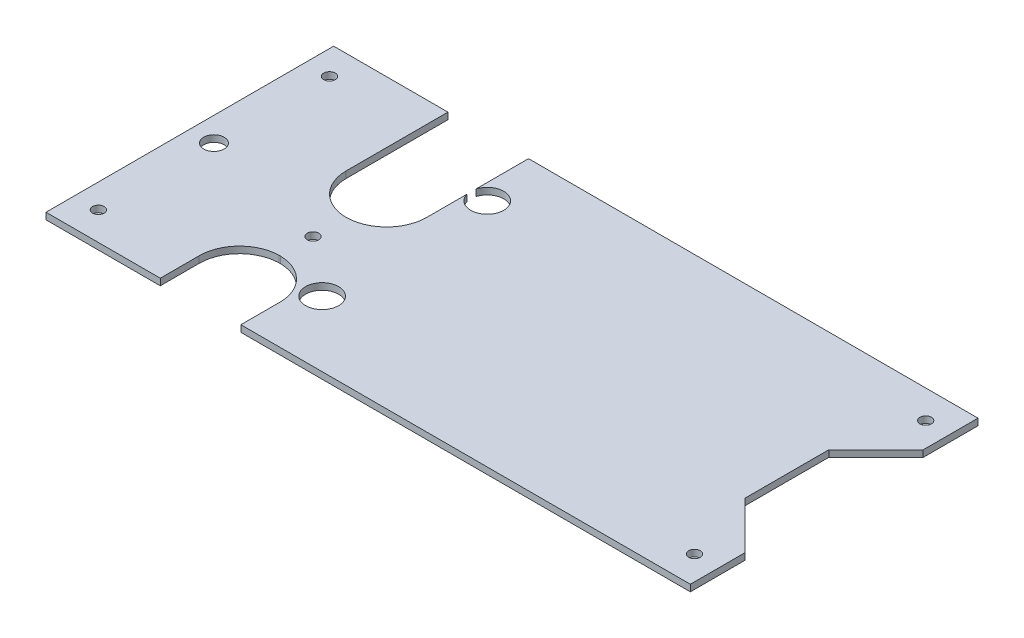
ISO-10303-21;
HEADER;
FILE_DESCRIPTION(('STEP AP214'),'2;1');
FILE_NAME('part.step','',(''),(''),'','','');
FILE_SCHEMA(('AUTOMOTIVE_DESIGN { 1 0 10303 214 1 1 1 1 }'));
ENDSEC;
DATA;
#1=APPLICATION_CONTEXT('core data for automotive mechanical design processes');
#2=APPLICATION_PROTOCOL_DEFINITION('international standard','automotive_design',2000,#1);
#3=PRODUCT_CONTEXT('',#1,'mechanical');
#4=PRODUCT('Part','Part','',(#3));
#5=PRODUCT_RELATED_PRODUCT_CATEGORY('part','',(#4));
#6=PRODUCT_DEFINITION_FORMATION('','',#4);
#7=PRODUCT_DEFINITION_CONTEXT('part definition',#1,'design');
#8=PRODUCT_DEFINITION('design','',#6,#7);
#9=PRODUCT_DEFINITION_SHAPE('','',#8);
#10=(LENGTH_UNIT() NAMED_UNIT(*) SI_UNIT(.MILLI.,.METRE.));
#11=(NAMED_UNIT(*) PLANE_ANGLE_UNIT() SI_UNIT($,.RADIAN.));
#12=(NAMED_UNIT(*) SI_UNIT($,.STERADIAN.) SOLID_ANGLE_UNIT());
#13=UNCERTAINTY_MEASURE_WITH_UNIT(LENGTH_MEASURE(1.E-05),#10,'distance_accuracy_value','');
#14=(GEOMETRIC_REPRESENTATION_CONTEXT(3) GLOBAL_UNCERTAINTY_ASSIGNED_CONTEXT((#13)) GLOBAL_UNIT_ASSIGNED_CONTEXT((#10,
#11,#12)) REPRESENTATION_CONTEXT('',''));
#15=CARTESIAN_POINT('',(0.,0.,0.));
#16=DIRECTION('',(0.,0.,1.));
#17=DIRECTION('',(1.,0.,0.));
#18=AXIS2_PLACEMENT_3D('',#15,#16,#17);
#19=CARTESIAN_POINT('',(-42.4176061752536,2.,33.7029048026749));
#20=DIRECTION('',(0.,1.,0.));
#21=DIRECTION('',(0.,0.,1.));
#22=AXIS2_PLACEMENT_3D('',#19,#20,#21);
#23=PLANE('',#22);
#24=CARTESIAN_POINT('',(98.5823938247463,2.,-33.0470951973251));
#25=DIRECTION('',(0.,1.,0.));
#26=DIRECTION('',(0.,0.,1.));
#27=AXIS2_PLACEMENT_3D('',#24,#25,#26);
#28=CIRCLE('',#27,1.75);
#29=CARTESIAN_POINT('',(98.5823938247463,2.,-31.2970951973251));
#30=VERTEX_POINT('',#29);
#31=EDGE_CURVE('E435',#30,#30,#28,.T.);
#32=ORIENTED_EDGE('',*,*,#31,.F.);
#33=EDGE_LOOP('',(#32));
#34=FACE_BOUND('',#33,.T.);
#35=CARTESIAN_POINT('',(-42.4176061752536,2.,11.4529048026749));
#36=DIRECTION('',(0.,1.,0.));
#37=DIRECTION('',(0.,0.,1.));
#38=AXIS2_PLACEMENT_3D('',#35,#36,#37);
#39=CIRCLE('',#38,1.75);
#40=CARTESIAN_POINT('',(-42.4176061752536,2.,13.2029048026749));
#41=VERTEX_POINT('',#40);
#42=EDGE_CURVE('E447',#41,#41,#39,.T.);
#43=ORIENTED_EDGE('',*,*,#42,.F.);
#44=EDGE_LOOP('',(#43));
#45=FACE_BOUND('',#44,.T.);
#46=CARTESIAN_POINT('',(-81.9176061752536,2.,36.9529048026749));
#47=DIRECTION('',(0.,1.,0.));
#48=DIRECTION('',(0.,0.,1.));
#49=AXIS2_PLACEMENT_3D('',#46,#47,#48);
#50=CIRCLE('',#49,1.75);
#51=CARTESIAN_POINT('',(-81.9176061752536,2.,38.7029048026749));
#52=VERTEX_POINT('',#51);
#53=EDGE_CURVE('E459',#52,#52,#50,.T.);
#54=ORIENTED_EDGE('',*,*,#53,.F.);
#55=EDGE_LOOP('',(#54));
#56=FACE_BOUND('',#55,.T.);
#57=CARTESIAN_POINT('',(-42.4176061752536,2.,33.7029048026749));
#58=DIRECTION('',(0.,-1.,0.));
#59=DIRECTION('',(0.,0.,1.));
#60=AXIS2_PLACEMENT_3D('',#57,#58,#59);
#61=CIRCLE('',#60,12.2);
#62=CARTESIAN_POINT('',(-54.6176061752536,2.,33.7029048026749));
#63=VERTEX_POINT('',#62);
#64=CARTESIAN_POINT('',(-42.6689869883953,2.,21.5054949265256));
#65=VERTEX_POINT('',#64);
#66=EDGE_CURVE('E259',#63,#65,#61,.T.);
#67=ORIENTED_EDGE('',*,*,#66,.T.);
#68=DIRECTION('',(1.,0.,0.));
#69=VECTOR('',#68,1.);
#70=CARTESIAN_POINT('',(-42.6689869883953,2.,21.5054949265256));
#71=LINE('',#70,#69);
#72=CARTESIAN_POINT('',(-42.1662253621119,2.,21.5054949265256));
#73=VERTEX_POINT('',#72);
#74=EDGE_CURVE('E137',#65,#73,#71,.T.);
#75=ORIENTED_EDGE('',*,*,#74,.T.);
#76=CARTESIAN_POINT('',(-42.4176061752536,2.,33.7029048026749));
#77=DIRECTION('',(0.,-1.,0.));
#78=DIRECTION('',(0.,0.,1.));
#79=AXIS2_PLACEMENT_3D('',#76,#77,#78);
#80=CIRCLE('',#79,12.2);
#81=CARTESIAN_POINT('',(-30.2176061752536,2.,33.7029048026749));
#82=VERTEX_POINT('',#81);
#83=EDGE_CURVE('E316',#73,#82,#80,.T.);
#84=ORIENTED_EDGE('',*,*,#83,.T.);
#85=DIRECTION('',(0.,0.,1.));
#86=VECTOR('',#85,1.);
#87=CARTESIAN_POINT('',(-30.2176061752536,2.,45.5029048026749));
#88=LINE('',#87,#86);
#89=CARTESIAN_POINT('',(-30.2176061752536,2.,45.5029048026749));
#90=VERTEX_POINT('',#89);
#91=EDGE_CURVE('E335',#82,#90,#88,.T.);
#92=ORIENTED_EDGE('',*,*,#91,.T.);
#93=DIRECTION('',(1.,0.,0.));
#94=VECTOR('',#93,1.);
#95=CARTESIAN_POINT('',(-30.2176061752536,2.,45.5029048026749));
#96=LINE('',#95,#94);
#97=CARTESIAN_POINT('',(105.882393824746,2.,45.5029048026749));
#98=VERTEX_POINT('',#97);
#99=EDGE_CURVE('E332',#90,#98,#96,.T.);
#100=ORIENTED_EDGE('',*,*,#99,.T.);
#101=DIRECTION('',(0.,0.,-1.));
#102=VECTOR('',#101,1.);
#103=CARTESIAN_POINT('',(105.882393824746,2.,45.5029048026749));
#104=LINE('',#103,#102);
#105=CARTESIAN_POINT('',(105.882393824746,2.,28.9171183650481));
#106=VERTEX_POINT('',#105);
#107=EDGE_CURVE('E334',#98,#106,#104,.T.);
#108=ORIENTED_EDGE('',*,*,#107,.T.);
#109=DIRECTION('',(-0.707106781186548,0.,-0.707106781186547));
#110=VECTOR('',#109,1.);
#111=CARTESIAN_POINT('',(91.5823938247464,2.,14.6171183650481));
#112=LINE('',#111,#110);
#113=CARTESIAN_POINT('',(91.5823938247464,2.,14.6171183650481));
#114=VERTEX_POINT('',#113);
#115=EDGE_CURVE('E337',#106,#114,#112,.T.);
#116=ORIENTED_EDGE('',*,*,#115,.T.);
#117=DIRECTION('',(0.,0.,-1.));
#118=VECTOR('',#117,1.);
#119=CARTESIAN_POINT('',(91.5823938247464,2.,-10.7113087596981));
#120=LINE('',#119,#118);
#121=CARTESIAN_POINT('',(91.5823938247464,2.,-10.7113087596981));
#122=VERTEX_POINT('',#121);
#123=EDGE_CURVE('E343',#114,#122,#120,.T.);
#124=ORIENTED_EDGE('',*,*,#123,.T.);
#125=DIRECTION('',(0.707106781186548,0.,-0.707106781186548));
#126=VECTOR('',#125,1.);
#127=CARTESIAN_POINT('',(105.882393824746,2.,-25.0113087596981));
#128=LINE('',#127,#126);
#129=CARTESIAN_POINT('',(105.882393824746,2.,-25.0113087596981));
#130=VERTEX_POINT('',#129);
#131=EDGE_CURVE('E345',#122,#130,#128,.T.);
#132=ORIENTED_EDGE('',*,*,#131,.T.);
#133=DIRECTION('',(0.,0.,-1.));
#134=VECTOR('',#133,1.);
#135=CARTESIAN_POINT('',(105.882393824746,2.,-25.0113087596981));
#136=LINE('',#135,#134);
#137=CARTESIAN_POINT('',(105.882393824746,2.,-41.5970951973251));
#138=VERTEX_POINT('',#137);
#139=EDGE_CURVE('E347',#130,#138,#136,.T.);
#140=ORIENTED_EDGE('',*,*,#139,.T.);
#141=DIRECTION('',(-1.,0.,0.));
#142=VECTOR('',#141,1.);
#143=CARTESIAN_POINT('',(-30.2176061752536,2.,-41.5970951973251));
#144=LINE('',#143,#142);
#145=CARTESIAN_POINT('',(-30.2176061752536,2.,-41.5970951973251));
#146=VERTEX_POINT('',#145);
#147=EDGE_CURVE('E349',#138,#146,#144,.T.);
#148=ORIENTED_EDGE('',*,*,#147,.T.);
#149=DIRECTION('',(0.,0.,1.));
#150=VECTOR('',#149,1.);
#151=CARTESIAN_POINT('',(-30.2176061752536,2.,-25.6971802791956));
#152=LINE('',#151,#150);
#153=CARTESIAN_POINT('',(-30.2176061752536,2.,-25.6971802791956));
#154=VERTEX_POINT('',#153);
#155=EDGE_CURVE('E351',#146,#154,#152,.T.);
#156=ORIENTED_EDGE('',*,*,#155,.T.);
#157=CARTESIAN_POINT('',(-25.4176286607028,2.,-24.2971031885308));
#158=DIRECTION('',(0.,-1.,0.));
#159=DIRECTION('',(0.,0.,1.));
#160=AXIS2_PLACEMENT_3D('',#157,#158,#159);
#161=CIRCLE('',#160,4.99999999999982);
#162=CARTESIAN_POINT('',(-30.2176061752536,2.,-22.8970260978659));
#163=VERTEX_POINT('',#162);
#164=EDGE_CURVE('E353',#154,#163,#161,.T.);
#165=ORIENTED_EDGE('',*,*,#164,.T.);
#166=DIRECTION('',(0.,0.,1.));
#167=VECTOR('',#166,1.);
#168=CARTESIAN_POINT('',(-30.2176061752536,2.,-10.7970951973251));
#169=LINE('',#168,#167);
#170=CARTESIAN_POINT('',(-30.2176061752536,2.,-10.7970951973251));
#171=VERTEX_POINT('',#170);
#172=EDGE_CURVE('E355',#163,#171,#169,.T.);
#173=ORIENTED_EDGE('',*,*,#172,.T.);
#174=CARTESIAN_POINT('',(-42.4176061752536,2.,-10.7970951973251));
#175=DIRECTION('',(0.,-1.,0.));
#176=DIRECTION('',(0.,0.,1.));
#177=AXIS2_PLACEMENT_3D('',#174,#175,#176);
#178=CIRCLE('',#177,12.2);
#179=CARTESIAN_POINT('',(-42.163439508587,2.,1.40025694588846));
#180=VERTEX_POINT('',#179);
#181=EDGE_CURVE('E357',#171,#180,#178,.T.);
#182=ORIENTED_EDGE('',*,*,#181,.T.);
#183=DIRECTION('',(-1.,0.,0.));
#184=VECTOR('',#183,1.);
#185=CARTESIAN_POINT('',(-42.6717728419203,2.,1.40025694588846));
#186=LINE('',#185,#184);
#187=CARTESIAN_POINT('',(-42.6717728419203,2.,1.40025694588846));
#188=VERTEX_POINT('',#187);
#189=EDGE_CURVE('E359',#180,#188,#186,.T.);
#190=ORIENTED_EDGE('',*,*,#189,.T.);
#191=CARTESIAN_POINT('',(-42.4176061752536,2.,-10.7970951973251));
#192=DIRECTION('',(0.,-1.,0.));
#193=DIRECTION('',(0.,0.,1.));
#194=AXIS2_PLACEMENT_3D('',#191,#192,#193);
#195=CIRCLE('',#194,12.2);
#196=CARTESIAN_POINT('',(-54.6176061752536,2.,-10.7970951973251));
#197=VERTEX_POINT('',#196);
#198=EDGE_CURVE('E361',#188,#197,#195,.T.);
#199=ORIENTED_EDGE('',*,*,#198,.T.);
#200=DIRECTION('',(0.,0.,-1.));
#201=VECTOR('',#200,1.);
#202=CARTESIAN_POINT('',(-54.6176061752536,2.,-41.5970951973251));
#203=LINE('',#202,#201);
#204=CARTESIAN_POINT('',(-54.6176061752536,2.,-41.5970951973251));
#205=VERTEX_POINT('',#204);
#206=EDGE_CURVE('E363',#197,#205,#203,.T.);
#207=ORIENTED_EDGE('',*,*,#206,.T.);
#208=DIRECTION('',(-1.,0.,0.));
#209=VECTOR('',#208,1.);
#210=CARTESIAN_POINT('',(-89.2176061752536,2.,-41.5970951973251));
#211=LINE('',#210,#209);
#212=CARTESIAN_POINT('',(-89.2176061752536,2.,-41.5970951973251));
#213=VERTEX_POINT('',#212);
#214=EDGE_CURVE('E198',#205,#213,#211,.T.);
#215=ORIENTED_EDGE('',*,*,#214,.T.);
#216=DIRECTION('',(0.,0.,1.));
#217=VECTOR('',#216,1.);
#218=CARTESIAN_POINT('',(-89.2176061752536,2.,-41.5970951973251));
#219=LINE('',#218,#217);
#220=CARTESIAN_POINT('',(-89.2176061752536,2.,45.5029048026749));
#221=VERTEX_POINT('',#220);
#222=EDGE_CURVE('E192',#213,#221,#219,.T.);
#223=ORIENTED_EDGE('',*,*,#222,.T.);
#224=DIRECTION('',(1.,0.,0.));
#225=VECTOR('',#224,1.);
#226=CARTESIAN_POINT('',(-89.2176061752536,2.,45.5029048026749));
#227=LINE('',#226,#225);
#228=CARTESIAN_POINT('',(-54.6176061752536,2.,45.5029048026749));
#229=VERTEX_POINT('',#228);
#230=EDGE_CURVE('E196',#221,#229,#227,.T.);
#231=ORIENTED_EDGE('',*,*,#230,.T.);
#232=DIRECTION('',(0.,0.,-1.));
#233=VECTOR('',#232,1.);
#234=CARTESIAN_POINT('',(-54.6176061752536,2.,33.7029048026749));
#235=LINE('',#234,#233);
#236=EDGE_CURVE('E52',#229,#63,#235,.T.);
#237=ORIENTED_EDGE('',*,*,#236,.T.);
#238=EDGE_LOOP('',(#67,#75,#84,#92,#100,#108,#116,#124,#132,#140,#148,#156,#165,#173,#182,#190,
#199,#207,#215,#223,#231,#237));
#239=FACE_BOUND('',#238,.T.);
#240=CARTESIAN_POINT('',(-81.9176061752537,2.,-33.0470951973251));
#241=DIRECTION('',(0.,1.,0.));
#242=DIRECTION('',(0.,0.,1.));
#243=AXIS2_PLACEMENT_3D('',#240,#241,#242);
#244=CIRCLE('',#243,1.75);
#245=CARTESIAN_POINT('',(-81.9176061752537,2.,-31.2970951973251));
#246=VERTEX_POINT('',#245);
#247=EDGE_CURVE('E220',#246,#246,#244,.T.);
#248=ORIENTED_EDGE('',*,*,#247,.F.);
#249=EDGE_LOOP('',(#248));
#250=FACE_BOUND('',#249,.T.);
#251=CARTESIAN_POINT('',(-81.9176061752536,2.,1.95290480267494));
#252=DIRECTION('',(0.,1.,0.));
#253=DIRECTION('',(0.,0.,1.));
#254=AXIS2_PLACEMENT_3D('',#251,#252,#253);
#255=CIRCLE('',#254,3.1);
#256=CARTESIAN_POINT('',(-81.9176061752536,2.,5.05290480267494));
#257=VERTEX_POINT('',#256);
#258=EDGE_CURVE('E453',#257,#257,#255,.T.);
#259=ORIENTED_EDGE('',*,*,#258,.F.);
#260=EDGE_LOOP('',(#259));
#261=FACE_BOUND('',#260,.T.);
#262=CARTESIAN_POINT('',(98.5823938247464,2.,36.9529048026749));
#263=DIRECTION('',(0.,1.,0.));
#264=DIRECTION('',(0.,0.,1.));
#265=AXIS2_PLACEMENT_3D('',#262,#263,#264);
#266=CIRCLE('',#265,1.75);
#267=CARTESIAN_POINT('',(98.5823938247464,2.,38.7029048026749));
#268=VERTEX_POINT('',#267);
#269=EDGE_CURVE('E441',#268,#268,#266,.T.);
#270=ORIENTED_EDGE('',*,*,#269,.F.);
#271=EDGE_LOOP('',(#270));
#272=FACE_BOUND('',#271,.T.);
#273=CARTESIAN_POINT('',(-25.4176286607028,2.,25.7028968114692));
#274=DIRECTION('',(0.,1.,0.));
#275=DIRECTION('',(0.,0.,1.));
#276=AXIS2_PLACEMENT_3D('',#273,#274,#275);
#277=CIRCLE('',#276,5.);
#278=CARTESIAN_POINT('',(-25.4176286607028,2.,30.7028968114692));
#279=VERTEX_POINT('',#278);
#280=EDGE_CURVE('E426',#279,#279,#277,.T.);
#281=ORIENTED_EDGE('',*,*,#280,.F.);
#282=EDGE_LOOP('',(#281));
#283=FACE_BOUND('',#282,.T.);
#284=ADVANCED_FACE('F35',(#34,#45,#56,#239,#250,#261,#272,#283),#23,.T.);
#285=CARTESIAN_POINT('',(-42.4176061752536,0.,33.7029048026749));
#286=DIRECTION('',(0.,1.,0.));
#287=DIRECTION('',(0.,0.,1.));
#288=AXIS2_PLACEMENT_3D('',#285,#286,#287);
#289=PLANE('',#288);
#290=CARTESIAN_POINT('',(-42.4176061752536,0.,33.7029048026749));
#291=DIRECTION('',(0.,-1.,0.));
#292=DIRECTION('',(0.,0.,1.));
#293=AXIS2_PLACEMENT_3D('',#290,#291,#292);
#294=CIRCLE('',#293,12.2);
#295=CARTESIAN_POINT('',(-54.6176061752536,0.,33.7029048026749));
#296=VERTEX_POINT('',#295);
#297=CARTESIAN_POINT('',(-42.6689869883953,0.,21.5054949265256));
#298=VERTEX_POINT('',#297);
#299=EDGE_CURVE('E216',#296,#298,#294,.T.);
#300=ORIENTED_EDGE('',*,*,#299,.F.);
#301=DIRECTION('',(0.,0.,-1.));
#302=VECTOR('',#301,1.);
#303=CARTESIAN_POINT('',(-54.6176061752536,0.,33.7029048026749));
#304=LINE('',#303,#302);
#305=CARTESIAN_POINT('',(-54.6176061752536,0.,45.5029048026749));
#306=VERTEX_POINT('',#305);
#307=EDGE_CURVE('E129',#306,#296,#304,.T.);
#308=ORIENTED_EDGE('',*,*,#307,.F.);
#309=DIRECTION('',(1.,0.,0.));
#310=VECTOR('',#309,1.);
#311=CARTESIAN_POINT('',(-89.2176061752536,0.,45.5029048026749));
#312=LINE('',#311,#310);
#313=CARTESIAN_POINT('',(-89.2176061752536,0.,45.5029048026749));
#314=VERTEX_POINT('',#313);
#315=EDGE_CURVE('E123',#314,#306,#312,.T.);
#316=ORIENTED_EDGE('',*,*,#315,.F.);
#317=DIRECTION('',(0.,0.,1.));
#318=VECTOR('',#317,1.);
#319=CARTESIAN_POINT('',(-89.2176061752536,0.,-41.5970951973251));
#320=LINE('',#319,#318);
#321=CARTESIAN_POINT('',(-89.2176061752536,0.,-41.5970951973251));
#322=VERTEX_POINT('',#321);
#323=EDGE_CURVE('E206',#322,#314,#320,.T.);
#324=ORIENTED_EDGE('',*,*,#323,.F.);
#325=DIRECTION('',(-1.,0.,0.));
#326=VECTOR('',#325,1.);
#327=CARTESIAN_POINT('',(-89.2176061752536,0.,-41.5970951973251));
#328=LINE('',#327,#326);
#329=CARTESIAN_POINT('',(-54.6176061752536,0.,-41.5970951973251));
#330=VERTEX_POINT('',#329);
#331=EDGE_CURVE('E254',#330,#322,#328,.T.);
#332=ORIENTED_EDGE('',*,*,#331,.F.);
#333=DIRECTION('',(0.,0.,-1.));
#334=VECTOR('',#333,1.);
#335=CARTESIAN_POINT('',(-54.6176061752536,0.,-41.5970951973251));
#336=LINE('',#335,#334);
#337=CARTESIAN_POINT('',(-54.6176061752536,0.,-10.7970951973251));
#338=VERTEX_POINT('',#337);
#339=EDGE_CURVE('E252',#338,#330,#336,.T.);
#340=ORIENTED_EDGE('',*,*,#339,.F.);
#341=CARTESIAN_POINT('',(-42.4176061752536,0.,-10.7970951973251));
#342=DIRECTION('',(0.,-1.,0.));
#343=DIRECTION('',(0.,0.,1.));
#344=AXIS2_PLACEMENT_3D('',#341,#342,#343);
#345=CIRCLE('',#344,12.2);
#346=CARTESIAN_POINT('',(-42.6717728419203,0.,1.40025694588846));
#347=VERTEX_POINT('',#346);
#348=EDGE_CURVE('E250',#347,#338,#345,.T.);
#349=ORIENTED_EDGE('',*,*,#348,.F.);
#350=DIRECTION('',(-1.,0.,0.));
#351=VECTOR('',#350,1.);
#352=CARTESIAN_POINT('',(-42.6717728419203,0.,1.40025694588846));
#353=LINE('',#352,#351);
#354=CARTESIAN_POINT('',(-42.163439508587,0.,1.40025694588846));
#355=VERTEX_POINT('',#354);
#356=EDGE_CURVE('E248',#355,#347,#353,.T.);
#357=ORIENTED_EDGE('',*,*,#356,.F.);
#358=CARTESIAN_POINT('',(-42.4176061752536,0.,-10.7970951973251));
#359=DIRECTION('',(0.,-1.,0.));
#360=DIRECTION('',(0.,0.,1.));
#361=AXIS2_PLACEMENT_3D('',#358,#359,#360);
#362=CIRCLE('',#361,12.2);
#363=CARTESIAN_POINT('',(-30.2176061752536,0.,-10.7970951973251));
#364=VERTEX_POINT('',#363);
#365=EDGE_CURVE('E246',#364,#355,#362,.T.);
#366=ORIENTED_EDGE('',*,*,#365,.F.);
#367=DIRECTION('',(0.,0.,1.));
#368=VECTOR('',#367,1.);
#369=CARTESIAN_POINT('',(-30.2176061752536,0.,-10.7970951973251));
#370=LINE('',#369,#368);
#371=CARTESIAN_POINT('',(-30.2176061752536,0.,-22.8970260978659));
#372=VERTEX_POINT('',#371);
#373=EDGE_CURVE('E244',#372,#364,#370,.T.);
#374=ORIENTED_EDGE('',*,*,#373,.F.);
#375=CARTESIAN_POINT('',(-25.4176286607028,0.,-24.2971031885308));
#376=DIRECTION('',(0.,-1.,0.));
#377=DIRECTION('',(0.,0.,1.));
#378=AXIS2_PLACEMENT_3D('',#375,#376,#377);
#379=CIRCLE('',#378,4.99999999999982);
#380=CARTESIAN_POINT('',(-30.2176061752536,0.,-25.6971802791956));
#381=VERTEX_POINT('',#380);
#382=EDGE_CURVE('E242',#381,#372,#379,.T.);
#383=ORIENTED_EDGE('',*,*,#382,.F.);
#384=DIRECTION('',(0.,0.,1.));
#385=VECTOR('',#384,1.);
#386=CARTESIAN_POINT('',(-30.2176061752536,0.,-25.6971802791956));
#387=LINE('',#386,#385);
#388=CARTESIAN_POINT('',(-30.2176061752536,0.,-41.5970951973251));
#389=VERTEX_POINT('',#388);
#390=EDGE_CURVE('E240',#389,#381,#387,.T.);
#391=ORIENTED_EDGE('',*,*,#390,.F.);
#392=DIRECTION('',(-1.,0.,0.));
#393=VECTOR('',#392,1.);
#394=CARTESIAN_POINT('',(-30.2176061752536,0.,-41.5970951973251));
#395=LINE('',#394,#393);
#396=CARTESIAN_POINT('',(105.882393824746,0.,-41.5970951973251));
#397=VERTEX_POINT('',#396);
#398=EDGE_CURVE('E238',#397,#389,#395,.T.);
#399=ORIENTED_EDGE('',*,*,#398,.F.);
#400=DIRECTION('',(0.,0.,-1.));
#401=VECTOR('',#400,1.);
#402=CARTESIAN_POINT('',(105.882393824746,0.,-25.0113087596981));
#403=LINE('',#402,#401);
#404=CARTESIAN_POINT('',(105.882393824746,0.,-25.0113087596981));
#405=VERTEX_POINT('',#404);
#406=EDGE_CURVE('E236',#405,#397,#403,.T.);
#407=ORIENTED_EDGE('',*,*,#406,.F.);
#408=DIRECTION('',(0.707106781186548,0.,-0.707106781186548));
#409=VECTOR('',#408,1.);
#410=CARTESIAN_POINT('',(105.882393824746,0.,-25.0113087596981));
#411=LINE('',#410,#409);
#412=CARTESIAN_POINT('',(91.5823938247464,0.,-10.7113087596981));
#413=VERTEX_POINT('',#412);
#414=EDGE_CURVE('E234',#413,#405,#411,.T.);
#415=ORIENTED_EDGE('',*,*,#414,.F.);
#416=DIRECTION('',(0.,0.,-1.));
#417=VECTOR('',#416,1.);
#418=CARTESIAN_POINT('',(91.5823938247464,0.,-10.7113087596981));
#419=LINE('',#418,#417);
#420=CARTESIAN_POINT('',(91.5823938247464,0.,14.6171183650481));
#421=VERTEX_POINT('',#420);
#422=EDGE_CURVE('E232',#421,#413,#419,.T.);
#423=ORIENTED_EDGE('',*,*,#422,.F.);
#424=DIRECTION('',(-0.707106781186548,0.,-0.707106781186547));
#425=VECTOR('',#424,1.);
#426=CARTESIAN_POINT('',(91.5823938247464,0.,14.6171183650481));
#427=LINE('',#426,#425);
#428=CARTESIAN_POINT('',(105.882393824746,0.,28.9171183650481));
#429=VERTEX_POINT('',#428);
#430=EDGE_CURVE('E230',#429,#421,#427,.T.);
#431=ORIENTED_EDGE('',*,*,#430,.F.);
#432=DIRECTION('',(0.,0.,-1.));
#433=VECTOR('',#432,1.);
#434=CARTESIAN_POINT('',(105.882393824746,0.,45.5029048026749));
#435=LINE('',#434,#433);
#436=CARTESIAN_POINT('',(105.882393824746,0.,45.5029048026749));
#437=VERTEX_POINT('',#436);
#438=EDGE_CURVE('E228',#437,#429,#435,.T.);
#439=ORIENTED_EDGE('',*,*,#438,.F.);
#440=DIRECTION('',(1.,0.,0.));
#441=VECTOR('',#440,1.);
#442=CARTESIAN_POINT('',(-30.2176061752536,0.,45.5029048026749));
#443=LINE('',#442,#441);
#444=CARTESIAN_POINT('',(-30.2176061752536,0.,45.5029048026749));
#445=VERTEX_POINT('',#444);
#446=EDGE_CURVE('E226',#445,#437,#443,.T.);
#447=ORIENTED_EDGE('',*,*,#446,.F.);
#448=DIRECTION('',(0.,0.,1.));
#449=VECTOR('',#448,1.);
#450=CARTESIAN_POINT('',(-30.2176061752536,0.,45.5029048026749));
#451=LINE('',#450,#449);
#452=CARTESIAN_POINT('',(-30.2176061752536,0.,33.7029048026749));
#453=VERTEX_POINT('',#452);
#454=EDGE_CURVE('E224',#453,#445,#451,.T.);
#455=ORIENTED_EDGE('',*,*,#454,.F.);
#456=CARTESIAN_POINT('',(-42.4176061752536,0.,33.7029048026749));
#457=DIRECTION('',(0.,-1.,0.));
#458=DIRECTION('',(0.,0.,1.));
#459=AXIS2_PLACEMENT_3D('',#456,#457,#458);
#460=CIRCLE('',#459,12.2);
#461=CARTESIAN_POINT('',(-42.1662253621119,0.,21.5054949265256));
#462=VERTEX_POINT('',#461);
#463=EDGE_CURVE('E222',#462,#453,#460,.T.);
#464=ORIENTED_EDGE('',*,*,#463,.F.);
#465=DIRECTION('',(1.,0.,0.));
#466=VECTOR('',#465,1.);
#467=CARTESIAN_POINT('',(-42.6689869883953,0.,21.5054949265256));
#468=LINE('',#467,#466);
#469=EDGE_CURVE('E219',#298,#462,#468,.T.);
#470=ORIENTED_EDGE('',*,*,#469,.F.);
#471=EDGE_LOOP('',(#300,#308,#316,#324,#332,#340,#349,#357,#366,#374,#383,#391,#399,#407,#415,
#423,#431,#439,#447,#455,#464,#470));
#472=FACE_BOUND('',#471,.T.);
#473=CARTESIAN_POINT('',(-81.9176061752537,0.,-33.0470951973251));
#474=DIRECTION('',(0.,1.,0.));
#475=DIRECTION('',(0.,0.,1.));
#476=AXIS2_PLACEMENT_3D('',#473,#474,#475);
#477=CIRCLE('',#476,1.75);
#478=CARTESIAN_POINT('',(-81.9176061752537,0.,-31.2970951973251));
#479=VERTEX_POINT('',#478);
#480=EDGE_CURVE('E462',#479,#479,#477,.T.);
#481=ORIENTED_EDGE('',*,*,#480,.T.);
#482=EDGE_LOOP('',(#481));
#483=FACE_BOUND('',#482,.T.);
#484=CARTESIAN_POINT('',(-81.9176061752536,0.,36.9529048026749));
#485=DIRECTION('',(0.,1.,0.));
#486=DIRECTION('',(0.,0.,1.));
#487=AXIS2_PLACEMENT_3D('',#484,#485,#486);
#488=CIRCLE('',#487,1.75);
#489=CARTESIAN_POINT('',(-81.9176061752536,0.,38.7029048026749));
#490=VERTEX_POINT('',#489);
#491=EDGE_CURVE('E456',#490,#490,#488,.T.);
#492=ORIENTED_EDGE('',*,*,#491,.T.);
#493=EDGE_LOOP('',(#492));
#494=FACE_BOUND('',#493,.T.);
#495=CARTESIAN_POINT('',(-81.9176061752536,0.,1.95290480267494));
#496=DIRECTION('',(0.,1.,0.));
#497=DIRECTION('',(0.,0.,1.));
#498=AXIS2_PLACEMENT_3D('',#495,#496,#497);
#499=CIRCLE('',#498,3.1);
#500=CARTESIAN_POINT('',(-81.9176061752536,0.,5.05290480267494));
#501=VERTEX_POINT('',#500);
#502=EDGE_CURVE('E450',#501,#501,#499,.T.);
#503=ORIENTED_EDGE('',*,*,#502,.T.);
#504=EDGE_LOOP('',(#503));
#505=FACE_BOUND('',#504,.T.);
#506=CARTESIAN_POINT('',(-42.4176061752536,0.,11.4529048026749));
#507=DIRECTION('',(0.,1.,0.));
#508=DIRECTION('',(0.,0.,1.));
#509=AXIS2_PLACEMENT_3D('',#506,#507,#508);
#510=CIRCLE('',#509,1.75);
#511=CARTESIAN_POINT('',(-42.4176061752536,0.,13.2029048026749));
#512=VERTEX_POINT('',#511);
#513=EDGE_CURVE('E444',#512,#512,#510,.T.);
#514=ORIENTED_EDGE('',*,*,#513,.T.);
#515=EDGE_LOOP('',(#514));
#516=FACE_BOUND('',#515,.T.);
#517=CARTESIAN_POINT('',(98.5823938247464,0.,36.9529048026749));
#518=DIRECTION('',(0.,1.,0.));
#519=DIRECTION('',(0.,0.,1.));
#520=AXIS2_PLACEMENT_3D('',#517,#518,#519);
#521=CIRCLE('',#520,1.75);
#522=CARTESIAN_POINT('',(98.5823938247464,0.,38.7029048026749));
#523=VERTEX_POINT('',#522);
#524=EDGE_CURVE('E438',#523,#523,#521,.T.);
#525=ORIENTED_EDGE('',*,*,#524,.T.);
#526=EDGE_LOOP('',(#525));
#527=FACE_BOUND('',#526,.T.);
#528=CARTESIAN_POINT('',(98.5823938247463,0.,-33.0470951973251));
#529=DIRECTION('',(0.,1.,0.));
#530=DIRECTION('',(0.,0.,1.));
#531=AXIS2_PLACEMENT_3D('',#528,#529,#530);
#532=CIRCLE('',#531,1.75);
#533=CARTESIAN_POINT('',(98.5823938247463,0.,-31.2970951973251));
#534=VERTEX_POINT('',#533);
#535=EDGE_CURVE('E432',#534,#534,#532,.T.);
#536=ORIENTED_EDGE('',*,*,#535,.T.);
#537=EDGE_LOOP('',(#536));
#538=FACE_BOUND('',#537,.T.);
#539=CARTESIAN_POINT('',(-25.4176286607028,0.,25.7028968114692));
#540=DIRECTION('',(0.,1.,0.));
#541=DIRECTION('',(0.,0.,1.));
#542=AXIS2_PLACEMENT_3D('',#539,#540,#541);
#543=CIRCLE('',#542,5.);
#544=CARTESIAN_POINT('',(-25.4176286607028,0.,30.7028968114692));
#545=VERTEX_POINT('',#544);
#546=EDGE_CURVE('E429',#545,#545,#543,.T.);
#547=ORIENTED_EDGE('',*,*,#546,.T.);
#548=EDGE_LOOP('',(#547));
#549=FACE_BOUND('',#548,.T.);
#550=ADVANCED_FACE('F320',(#472,#483,#494,#505,#516,#527,#538,#549),#289,.F.);
#551=CARTESIAN_POINT('',(-42.4176061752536,2.,33.7029048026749));
#552=DIRECTION('',(0.,-1.,0.));
#553=DIRECTION('',(0.,0.,-1.));
#554=AXIS2_PLACEMENT_3D('',#551,#552,#553);
#555=CYLINDRICAL_SURFACE('',#554,12.2);
#556=ORIENTED_EDGE('',*,*,#299,.T.);
#557=DIRECTION('',(0.,-1.,0.));
#558=VECTOR('',#557,1.);
#559=CARTESIAN_POINT('',(-42.6689869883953,2.,21.5054949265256));
#560=LINE('',#559,#558);
#561=EDGE_CURVE('E11',#65,#298,#560,.T.);
#562=ORIENTED_EDGE('',*,*,#561,.F.);
#563=ORIENTED_EDGE('',*,*,#66,.F.);
#564=DIRECTION('',(0.,-1.,0.));
#565=VECTOR('',#564,1.);
#566=CARTESIAN_POINT('',(-54.6176061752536,2.,33.7029048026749));
#567=LINE('',#566,#565);
#568=EDGE_CURVE('E212',#63,#296,#567,.T.);
#569=ORIENTED_EDGE('',*,*,#568,.T.);
#570=EDGE_LOOP('',(#556,#562,#563,#569));
#571=FACE_BOUND('',#570,.T.);
#572=ADVANCED_FACE('F37',(#571),#555,.F.);
#573=CARTESIAN_POINT('',(-42.6689869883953,2.,21.5054949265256));
#574=DIRECTION('',(0.,0.,-1.));
#575=DIRECTION('',(-1.,0.,0.));
#576=AXIS2_PLACEMENT_3D('',#573,#574,#575);
#577=PLANE('',#576);
#578=ORIENTED_EDGE('',*,*,#469,.T.);
#579=DIRECTION('',(0.,-1.,0.));
#580=VECTOR('',#579,1.);
#581=CARTESIAN_POINT('',(-42.1662253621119,2.,21.5054949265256));
#582=LINE('',#581,#580);
#583=EDGE_CURVE('E44',#73,#462,#582,.T.);
#584=ORIENTED_EDGE('',*,*,#583,.F.);
#585=ORIENTED_EDGE('',*,*,#74,.F.);
#586=ORIENTED_EDGE('',*,*,#561,.T.);
#587=EDGE_LOOP('',(#578,#584,#585,#586));
#588=FACE_BOUND('',#587,.T.);
#589=ADVANCED_FACE('F699',(#588),#577,.F.);
#590=CARTESIAN_POINT('',(-42.4176061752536,2.,33.7029048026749));
#591=DIRECTION('',(0.,-1.,0.));
#592=DIRECTION('',(0.,0.,-1.));
#593=AXIS2_PLACEMENT_3D('',#590,#591,#592);
#594=CYLINDRICAL_SURFACE('',#593,12.2);
#595=ORIENTED_EDGE('',*,*,#463,.T.);
#596=DIRECTION('',(0.,-1.,0.));
#597=VECTOR('',#596,1.);
#598=CARTESIAN_POINT('',(-30.2176061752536,2.,33.7029048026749));
#599=LINE('',#598,#597);
#600=EDGE_CURVE('E308',#82,#453,#599,.T.);
#601=ORIENTED_EDGE('',*,*,#600,.F.);
#602=ORIENTED_EDGE('',*,*,#83,.F.);
#603=ORIENTED_EDGE('',*,*,#583,.T.);
#604=EDGE_LOOP('',(#595,#601,#602,#603));
#605=FACE_BOUND('',#604,.T.);
#606=ADVANCED_FACE('F314',(#605),#594,.F.);
#607=CARTESIAN_POINT('',(-30.2176061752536,2.,45.5029048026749));
#608=DIRECTION('',(1.,0.,0.));
#609=DIRECTION('',(0.,0.,-1.));
#610=AXIS2_PLACEMENT_3D('',#607,#608,#609);
#611=PLANE('',#610);
#612=ORIENTED_EDGE('',*,*,#454,.T.);
#613=DIRECTION('',(0.,-1.,0.));
#614=VECTOR('',#613,1.);
#615=CARTESIAN_POINT('',(-30.2176061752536,2.,45.5029048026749));
#616=LINE('',#615,#614);
#617=EDGE_CURVE('E305',#90,#445,#616,.T.);
#618=ORIENTED_EDGE('',*,*,#617,.F.);
#619=ORIENTED_EDGE('',*,*,#91,.F.);
#620=ORIENTED_EDGE('',*,*,#600,.T.);
#621=EDGE_LOOP('',(#612,#618,#619,#620));
#622=FACE_BOUND('',#621,.T.);
#623=ADVANCED_FACE('F326',(#622),#611,.F.);
#624=CARTESIAN_POINT('',(-30.2176061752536,2.,45.5029048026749));
#625=DIRECTION('',(0.,0.,-1.));
#626=DIRECTION('',(-1.,0.,0.));
#627=AXIS2_PLACEMENT_3D('',#624,#625,#626);
#628=PLANE('',#627);
#629=ORIENTED_EDGE('',*,*,#446,.T.);
#630=DIRECTION('',(0.,-1.,0.));
#631=VECTOR('',#630,1.);
#632=CARTESIAN_POINT('',(105.882393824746,2.,45.5029048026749));
#633=LINE('',#632,#631);
#634=EDGE_CURVE('E302',#98,#437,#633,.T.);
#635=ORIENTED_EDGE('',*,*,#634,.F.);
#636=ORIENTED_EDGE('',*,*,#99,.F.);
#637=ORIENTED_EDGE('',*,*,#617,.T.);
#638=EDGE_LOOP('',(#629,#635,#636,#637));
#639=FACE_BOUND('',#638,.T.);
#640=ADVANCED_FACE('F330',(#639),#628,.F.);
#641=CARTESIAN_POINT('',(105.882393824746,2.,45.5029048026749));
#642=DIRECTION('',(-1.,0.,0.));
#643=DIRECTION('',(0.,0.,1.));
#644=AXIS2_PLACEMENT_3D('',#641,#642,#643);
#645=PLANE('',#644);
#646=ORIENTED_EDGE('',*,*,#438,.T.);
#647=DIRECTION('',(0.,-1.,0.));
#648=VECTOR('',#647,1.);
#649=CARTESIAN_POINT('',(105.882393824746,2.,28.9171183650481));
#650=LINE('',#649,#648);
#651=EDGE_CURVE('E299',#106,#429,#650,.T.);
#652=ORIENTED_EDGE('',*,*,#651,.F.);
#653=ORIENTED_EDGE('',*,*,#107,.F.);
#654=ORIENTED_EDGE('',*,*,#634,.T.);
#655=EDGE_LOOP('',(#646,#652,#653,#654));
#656=FACE_BOUND('',#655,.T.);
#657=ADVANCED_FACE('F664',(#656),#645,.F.);
#658=CARTESIAN_POINT('',(91.5823938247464,2.,14.6171183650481));
#659=DIRECTION('',(-0.707106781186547,0.,0.707106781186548));
#660=DIRECTION('',(0.707106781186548,0.,0.707106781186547));
#661=AXIS2_PLACEMENT_3D('',#658,#659,#660);
#662=PLANE('',#661);
#663=ORIENTED_EDGE('',*,*,#430,.T.);
#664=DIRECTION('',(0.,-1.,0.));
#665=VECTOR('',#664,1.);
#666=CARTESIAN_POINT('',(91.5823938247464,2.,14.6171183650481));
#667=LINE('',#666,#665);
#668=EDGE_CURVE('E296',#114,#421,#667,.T.);
#669=ORIENTED_EDGE('',*,*,#668,.F.);
#670=ORIENTED_EDGE('',*,*,#115,.F.);
#671=ORIENTED_EDGE('',*,*,#651,.T.);
#672=EDGE_LOOP('',(#663,#669,#670,#671));
#673=FACE_BOUND('',#672,.T.);
#674=ADVANCED_FACE('F654',(#673),#662,.F.);
#675=CARTESIAN_POINT('',(91.5823938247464,2.,-10.7113087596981));
#676=DIRECTION('',(-1.,0.,0.));
#677=DIRECTION('',(0.,0.,1.));
#678=AXIS2_PLACEMENT_3D('',#675,#676,#677);
#679=PLANE('',#678);
#680=ORIENTED_EDGE('',*,*,#422,.T.);
#681=DIRECTION('',(0.,-1.,0.));
#682=VECTOR('',#681,1.);
#683=CARTESIAN_POINT('',(91.5823938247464,2.,-10.7113087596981));
#684=LINE('',#683,#682);
#685=EDGE_CURVE('E293',#122,#413,#684,.T.);
#686=ORIENTED_EDGE('',*,*,#685,.F.);
#687=ORIENTED_EDGE('',*,*,#123,.F.);
#688=ORIENTED_EDGE('',*,*,#668,.T.);
#689=EDGE_LOOP('',(#680,#686,#687,#688));
#690=FACE_BOUND('',#689,.T.);
#691=ADVANCED_FACE('F644',(#690),#679,.F.);
#692=CARTESIAN_POINT('',(105.882393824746,2.,-25.0113087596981));
#693=DIRECTION('',(-0.707106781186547,0.,-0.707106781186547));
#694=DIRECTION('',(-0.707106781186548,0.,0.707106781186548));
#695=AXIS2_PLACEMENT_3D('',#692,#693,#694);
#696=PLANE('',#695);
#697=ORIENTED_EDGE('',*,*,#414,.T.);
#698=DIRECTION('',(0.,-1.,0.));
#699=VECTOR('',#698,1.);
#700=CARTESIAN_POINT('',(105.882393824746,2.,-25.0113087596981));
#701=LINE('',#700,#699);
#702=EDGE_CURVE('E290',#130,#405,#701,.T.);
#703=ORIENTED_EDGE('',*,*,#702,.F.);
#704=ORIENTED_EDGE('',*,*,#131,.F.);
#705=ORIENTED_EDGE('',*,*,#685,.T.);
#706=EDGE_LOOP('',(#697,#703,#704,#705));
#707=FACE_BOUND('',#706,.T.);
#708=ADVANCED_FACE('F634',(#707),#696,.F.);
#709=CARTESIAN_POINT('',(105.882393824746,2.,-25.0113087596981));
#710=DIRECTION('',(-1.,0.,0.));
#711=DIRECTION('',(0.,0.,1.));
#712=AXIS2_PLACEMENT_3D('',#709,#710,#711);
#713=PLANE('',#712);
#714=ORIENTED_EDGE('',*,*,#406,.T.);
#715=DIRECTION('',(0.,-1.,0.));
#716=VECTOR('',#715,1.);
#717=CARTESIAN_POINT('',(105.882393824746,2.,-41.5970951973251));
#718=LINE('',#717,#716);
#719=EDGE_CURVE('E287',#138,#397,#718,.T.);
#720=ORIENTED_EDGE('',*,*,#719,.F.);
#721=ORIENTED_EDGE('',*,*,#139,.F.);
#722=ORIENTED_EDGE('',*,*,#702,.T.);
#723=EDGE_LOOP('',(#714,#720,#721,#722));
#724=FACE_BOUND('',#723,.T.);
#725=ADVANCED_FACE('F624',(#724),#713,.F.);
#726=CARTESIAN_POINT('',(-30.2176061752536,2.,-41.5970951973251));
#727=DIRECTION('',(0.,0.,1.));
#728=DIRECTION('',(1.,0.,0.));
#729=AXIS2_PLACEMENT_3D('',#726,#727,#728);
#730=PLANE('',#729);
#731=ORIENTED_EDGE('',*,*,#398,.T.);
#732=DIRECTION('',(0.,-1.,0.));
#733=VECTOR('',#732,1.);
#734=CARTESIAN_POINT('',(-30.2176061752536,2.,-41.5970951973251));
#735=LINE('',#734,#733);
#736=EDGE_CURVE('E284',#146,#389,#735,.T.);
#737=ORIENTED_EDGE('',*,*,#736,.F.);
#738=ORIENTED_EDGE('',*,*,#147,.F.);
#739=ORIENTED_EDGE('',*,*,#719,.T.);
#740=EDGE_LOOP('',(#731,#737,#738,#739));
#741=FACE_BOUND('',#740,.T.);
#742=ADVANCED_FACE('F614',(#741),#730,.F.);
#743=CARTESIAN_POINT('',(-30.2176061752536,2.,-25.6971802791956));
#744=DIRECTION('',(1.,0.,0.));
#745=DIRECTION('',(0.,0.,-1.));
#746=AXIS2_PLACEMENT_3D('',#743,#744,#745);
#747=PLANE('',#746);
#748=ORIENTED_EDGE('',*,*,#390,.T.);
#749=DIRECTION('',(0.,-1.,0.));
#750=VECTOR('',#749,1.);
#751=CARTESIAN_POINT('',(-30.2176061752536,2.,-25.6971802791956));
#752=LINE('',#751,#750);
#753=EDGE_CURVE('E281',#154,#381,#752,.T.);
#754=ORIENTED_EDGE('',*,*,#753,.F.);
#755=ORIENTED_EDGE('',*,*,#155,.F.);
#756=ORIENTED_EDGE('',*,*,#736,.T.);
#757=EDGE_LOOP('',(#748,#754,#755,#756));
#758=FACE_BOUND('',#757,.T.);
#759=ADVANCED_FACE('F604',(#758),#747,.F.);
#760=CARTESIAN_POINT('',(-25.4176286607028,2.,-24.2971031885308));
#761=DIRECTION('',(0.,-1.,0.));
#762=DIRECTION('',(0.,0.,-1.));
#763=AXIS2_PLACEMENT_3D('',#760,#761,#762);
#764=CYLINDRICAL_SURFACE('',#763,4.99999999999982);
#765=ORIENTED_EDGE('',*,*,#382,.T.);
#766=DIRECTION('',(0.,-1.,0.));
#767=VECTOR('',#766,1.);
#768=CARTESIAN_POINT('',(-30.2176061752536,2.,-22.8970260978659));
#769=LINE('',#768,#767);
#770=EDGE_CURVE('E278',#163,#372,#769,.T.);
#771=ORIENTED_EDGE('',*,*,#770,.F.);
#772=ORIENTED_EDGE('',*,*,#164,.F.);
#773=ORIENTED_EDGE('',*,*,#753,.T.);
#774=EDGE_LOOP('',(#765,#771,#772,#773));
#775=FACE_BOUND('',#774,.T.);
#776=ADVANCED_FACE('F594',(#775),#764,.F.);
#777=CARTESIAN_POINT('',(-30.2176061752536,2.,-10.7970951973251));
#778=DIRECTION('',(1.,0.,0.));
#779=DIRECTION('',(0.,0.,-1.));
#780=AXIS2_PLACEMENT_3D('',#777,#778,#779);
#781=PLANE('',#780);
#782=ORIENTED_EDGE('',*,*,#373,.T.);
#783=DIRECTION('',(0.,-1.,0.));
#784=VECTOR('',#783,1.);
#785=CARTESIAN_POINT('',(-30.2176061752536,2.,-10.7970951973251));
#786=LINE('',#785,#784);
#787=EDGE_CURVE('E275',#171,#364,#786,.T.);
#788=ORIENTED_EDGE('',*,*,#787,.F.);
#789=ORIENTED_EDGE('',*,*,#172,.F.);
#790=ORIENTED_EDGE('',*,*,#770,.T.);
#791=EDGE_LOOP('',(#782,#788,#789,#790));
#792=FACE_BOUND('',#791,.T.);
#793=ADVANCED_FACE('F584',(#792),#781,.F.);
#794=CARTESIAN_POINT('',(-42.4176061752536,2.,-10.7970951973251));
#795=DIRECTION('',(0.,-1.,0.));
#796=DIRECTION('',(0.,0.,-1.));
#797=AXIS2_PLACEMENT_3D('',#794,#795,#796);
#798=CYLINDRICAL_SURFACE('',#797,12.2);
#799=ORIENTED_EDGE('',*,*,#365,.T.);
#800=DIRECTION('',(0.,-1.,0.));
#801=VECTOR('',#800,1.);
#802=CARTESIAN_POINT('',(-42.163439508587,2.,1.40025694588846));
#803=LINE('',#802,#801);
#804=EDGE_CURVE('E272',#180,#355,#803,.T.);
#805=ORIENTED_EDGE('',*,*,#804,.F.);
#806=ORIENTED_EDGE('',*,*,#181,.F.);
#807=ORIENTED_EDGE('',*,*,#787,.T.);
#808=EDGE_LOOP('',(#799,#805,#806,#807));
#809=FACE_BOUND('',#808,.T.);
#810=ADVANCED_FACE('F574',(#809),#798,.F.);
#811=CARTESIAN_POINT('',(-42.6717728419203,2.,1.40025694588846));
#812=DIRECTION('',(0.,0.,1.));
#813=DIRECTION('',(1.,0.,0.));
#814=AXIS2_PLACEMENT_3D('',#811,#812,#813);
#815=PLANE('',#814);
#816=ORIENTED_EDGE('',*,*,#356,.T.);
#817=DIRECTION('',(0.,-1.,0.));
#818=VECTOR('',#817,1.);
#819=CARTESIAN_POINT('',(-42.6717728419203,2.,1.40025694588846));
#820=LINE('',#819,#818);
#821=EDGE_CURVE('E269',#188,#347,#820,.T.);
#822=ORIENTED_EDGE('',*,*,#821,.F.);
#823=ORIENTED_EDGE('',*,*,#189,.F.);
#824=ORIENTED_EDGE('',*,*,#804,.T.);
#825=EDGE_LOOP('',(#816,#822,#823,#824));
#826=FACE_BOUND('',#825,.T.);
#827=ADVANCED_FACE('F564',(#826),#815,.F.);
#828=CARTESIAN_POINT('',(-42.4176061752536,2.,-10.7970951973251));
#829=DIRECTION('',(0.,-1.,0.));
#830=DIRECTION('',(0.,0.,-1.));
#831=AXIS2_PLACEMENT_3D('',#828,#829,#830);
#832=CYLINDRICAL_SURFACE('',#831,12.2);
#833=ORIENTED_EDGE('',*,*,#348,.T.);
#834=DIRECTION('',(0.,-1.,0.));
#835=VECTOR('',#834,1.);
#836=CARTESIAN_POINT('',(-54.6176061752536,2.,-10.7970951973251));
#837=LINE('',#836,#835);
#838=EDGE_CURVE('E266',#197,#338,#837,.T.);
#839=ORIENTED_EDGE('',*,*,#838,.F.);
#840=ORIENTED_EDGE('',*,*,#198,.F.);
#841=ORIENTED_EDGE('',*,*,#821,.T.);
#842=EDGE_LOOP('',(#833,#839,#840,#841));
#843=FACE_BOUND('',#842,.T.);
#844=ADVANCED_FACE('F555',(#843),#832,.F.);
#845=CARTESIAN_POINT('',(-54.6176061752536,2.,-41.5970951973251));
#846=DIRECTION('',(-1.,0.,0.));
#847=DIRECTION('',(0.,0.,1.));
#848=AXIS2_PLACEMENT_3D('',#845,#846,#847);
#849=PLANE('',#848);
#850=ORIENTED_EDGE('',*,*,#339,.T.);
#851=DIRECTION('',(0.,-1.,0.));
#852=VECTOR('',#851,1.);
#853=CARTESIAN_POINT('',(-54.6176061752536,2.,-41.5970951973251));
#854=LINE('',#853,#852);
#855=EDGE_CURVE('E263',#205,#330,#854,.T.);
#856=ORIENTED_EDGE('',*,*,#855,.F.);
#857=ORIENTED_EDGE('',*,*,#206,.F.);
#858=ORIENTED_EDGE('',*,*,#838,.T.);
#859=EDGE_LOOP('',(#850,#856,#857,#858));
#860=FACE_BOUND('',#859,.T.);
#861=ADVANCED_FACE('F369',(#860),#849,.F.);
#862=CARTESIAN_POINT('',(-89.2176061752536,2.,-41.5970951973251));
#863=DIRECTION('',(0.,0.,1.));
#864=DIRECTION('',(1.,0.,0.));
#865=AXIS2_PLACEMENT_3D('',#862,#863,#864);
#866=PLANE('',#865);
#867=ORIENTED_EDGE('',*,*,#331,.T.);
#868=DIRECTION('',(0.,-1.,0.));
#869=VECTOR('',#868,1.);
#870=CARTESIAN_POINT('',(-89.2176061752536,2.,-41.5970951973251));
#871=LINE('',#870,#869);
#872=EDGE_CURVE('E207',#213,#322,#871,.T.);
#873=ORIENTED_EDGE('',*,*,#872,.F.);
#874=ORIENTED_EDGE('',*,*,#214,.F.);
#875=ORIENTED_EDGE('',*,*,#855,.T.);
#876=EDGE_LOOP('',(#867,#873,#874,#875));
#877=FACE_BOUND('',#876,.T.);
#878=ADVANCED_FACE('F373',(#877),#866,.F.);
#879=CARTESIAN_POINT('',(-89.2176061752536,2.,-41.5970951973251));
#880=DIRECTION('',(1.,0.,0.));
#881=DIRECTION('',(0.,0.,-1.));
#882=AXIS2_PLACEMENT_3D('',#879,#880,#881);
#883=PLANE('',#882);
#884=ORIENTED_EDGE('',*,*,#323,.T.);
#885=DIRECTION('',(0.,-1.,0.));
#886=VECTOR('',#885,1.);
#887=CARTESIAN_POINT('',(-89.2176061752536,2.,45.5029048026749));
#888=LINE('',#887,#886);
#889=EDGE_CURVE('E203',#221,#314,#888,.T.);
#890=ORIENTED_EDGE('',*,*,#889,.F.);
#891=ORIENTED_EDGE('',*,*,#222,.F.);
#892=ORIENTED_EDGE('',*,*,#872,.T.);
#893=EDGE_LOOP('',(#884,#890,#891,#892));
#894=FACE_BOUND('',#893,.T.);
#895=ADVANCED_FACE('F204',(#894),#883,.F.);
#896=CARTESIAN_POINT('',(-89.2176061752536,2.,45.5029048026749));
#897=DIRECTION('',(0.,0.,-1.));
#898=DIRECTION('',(-1.,0.,0.));
#899=AXIS2_PLACEMENT_3D('',#896,#897,#898);
#900=PLANE('',#899);
#901=ORIENTED_EDGE('',*,*,#315,.T.);
#902=DIRECTION('',(0.,-1.,0.));
#903=VECTOR('',#902,1.);
#904=CARTESIAN_POINT('',(-54.6176061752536,2.,45.5029048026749));
#905=LINE('',#904,#903);
#906=EDGE_CURVE('E208',#229,#306,#905,.T.);
#907=ORIENTED_EDGE('',*,*,#906,.F.);
#908=ORIENTED_EDGE('',*,*,#230,.F.);
#909=ORIENTED_EDGE('',*,*,#889,.T.);
#910=EDGE_LOOP('',(#901,#907,#908,#909));
#911=FACE_BOUND('',#910,.T.);
#912=ADVANCED_FACE('F210',(#911),#900,.F.);
#913=CARTESIAN_POINT('',(-54.6176061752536,2.,33.7029048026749));
#914=DIRECTION('',(-1.,0.,0.));
#915=DIRECTION('',(0.,0.,1.));
#916=AXIS2_PLACEMENT_3D('',#913,#914,#915);
#917=PLANE('',#916);
#918=ORIENTED_EDGE('',*,*,#307,.T.);
#919=ORIENTED_EDGE('',*,*,#568,.F.);
#920=ORIENTED_EDGE('',*,*,#236,.F.);
#921=ORIENTED_EDGE('',*,*,#906,.T.);
#922=EDGE_LOOP('',(#918,#919,#920,#921));
#923=FACE_BOUND('',#922,.T.);
#924=ADVANCED_FACE('F377',(#923),#917,.F.);
#925=CARTESIAN_POINT('',(-81.9176061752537,2.,-33.0470951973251));
#926=DIRECTION('',(0.,-1.,0.));
#927=DIRECTION('',(0.,0.,-1.));
#928=AXIS2_PLACEMENT_3D('',#925,#926,#927);
#929=CYLINDRICAL_SURFACE('',#928,1.75);
#930=ORIENTED_EDGE('',*,*,#247,.T.);
#931=EDGE_LOOP('',(#930));
#932=FACE_BOUND('',#931,.T.);
#933=ORIENTED_EDGE('',*,*,#480,.F.);
#934=EDGE_LOOP('',(#933));
#935=FACE_BOUND('',#934,.T.);
#936=ADVANCED_FACE('F379',(#932,#935),#929,.F.);
#937=CARTESIAN_POINT('',(-81.9176061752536,2.,36.9529048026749));
#938=DIRECTION('',(0.,-1.,0.));
#939=DIRECTION('',(0.,0.,-1.));
#940=AXIS2_PLACEMENT_3D('',#937,#938,#939);
#941=CYLINDRICAL_SURFACE('',#940,1.75);
#942=ORIENTED_EDGE('',*,*,#53,.T.);
#943=EDGE_LOOP('',(#942));
#944=FACE_BOUND('',#943,.T.);
#945=ORIENTED_EDGE('',*,*,#491,.F.);
#946=EDGE_LOOP('',(#945));
#947=FACE_BOUND('',#946,.T.);
#948=ADVANCED_FACE('F385',(#944,#947),#941,.F.);
#949=CARTESIAN_POINT('',(-81.9176061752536,2.,1.95290480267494));
#950=DIRECTION('',(0.,-1.,0.));
#951=DIRECTION('',(0.,0.,-1.));
#952=AXIS2_PLACEMENT_3D('',#949,#950,#951);
#953=CYLINDRICAL_SURFACE('',#952,3.1);
#954=ORIENTED_EDGE('',*,*,#258,.T.);
#955=EDGE_LOOP('',(#954));
#956=FACE_BOUND('',#955,.T.);
#957=ORIENTED_EDGE('',*,*,#502,.F.);
#958=EDGE_LOOP('',(#957));
#959=FACE_BOUND('',#958,.T.);
#960=ADVANCED_FACE('F401',(#956,#959),#953,.F.);
#961=CARTESIAN_POINT('',(-42.4176061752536,2.,11.4529048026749));
#962=DIRECTION('',(0.,-1.,0.));
#963=DIRECTION('',(0.,0.,-1.));
#964=AXIS2_PLACEMENT_3D('',#961,#962,#963);
#965=CYLINDRICAL_SURFACE('',#964,1.75);
#966=ORIENTED_EDGE('',*,*,#42,.T.);
#967=EDGE_LOOP('',(#966));
#968=FACE_BOUND('',#967,.T.);
#969=ORIENTED_EDGE('',*,*,#513,.F.);
#970=EDGE_LOOP('',(#969));
#971=FACE_BOUND('',#970,.T.);
#972=ADVANCED_FACE('F405',(#968,#971),#965,.F.);
#973=CARTESIAN_POINT('',(98.5823938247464,2.,36.9529048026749));
#974=DIRECTION('',(0.,-1.,0.));
#975=DIRECTION('',(0.,0.,-1.));
#976=AXIS2_PLACEMENT_3D('',#973,#974,#975);
#977=CYLINDRICAL_SURFACE('',#976,1.75);
#978=ORIENTED_EDGE('',*,*,#269,.T.);
#979=EDGE_LOOP('',(#978));
#980=FACE_BOUND('',#979,.T.);
#981=ORIENTED_EDGE('',*,*,#524,.F.);
#982=EDGE_LOOP('',(#981));
#983=FACE_BOUND('',#982,.T.);
#984=ADVANCED_FACE('F409',(#980,#983),#977,.F.);
#985=CARTESIAN_POINT('',(98.5823938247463,2.,-33.0470951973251));
#986=DIRECTION('',(0.,-1.,0.));
#987=DIRECTION('',(0.,0.,-1.));
#988=AXIS2_PLACEMENT_3D('',#985,#986,#987);
#989=CYLINDRICAL_SURFACE('',#988,1.75);
#990=ORIENTED_EDGE('',*,*,#31,.T.);
#991=EDGE_LOOP('',(#990));
#992=FACE_BOUND('',#991,.T.);
#993=ORIENTED_EDGE('',*,*,#535,.F.);
#994=EDGE_LOOP('',(#993));
#995=FACE_BOUND('',#994,.T.);
#996=ADVANCED_FACE('F413',(#992,#995),#989,.F.);
#997=CARTESIAN_POINT('',(-25.4176286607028,2.,25.7028968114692));
#998=DIRECTION('',(0.,-1.,0.));
#999=DIRECTION('',(0.,0.,-1.));
#1000=AXIS2_PLACEMENT_3D('',#997,#998,#999);
#1001=CYLINDRICAL_SURFACE('',#1000,5.);
#1002=ORIENTED_EDGE('',*,*,#280,.T.);
#1003=EDGE_LOOP('',(#1002));
#1004=FACE_BOUND('',#1003,.T.);
#1005=ORIENTED_EDGE('',*,*,#546,.F.);
#1006=EDGE_LOOP('',(#1005));
#1007=FACE_BOUND('',#1006,.T.);
#1008=ADVANCED_FACE('F417',(#1004,#1007),#1001,.F.);
#1009=CLOSED_SHELL('',(#284,#550,#572,#589,#606,#623,#640,#657,#674,#691,#708,#725,#742,#759,
#776,#793,#810,#827,#844,#861,#878,#895,#912,#924,#936,#948,#960,#972,#984,#996,#1008));
#1010=MANIFOLD_SOLID_BREP('B2',#1009);
#1011=ADVANCED_BREP_SHAPE_REPRESENTATION('',(#18,#1010),#14);
#1012=SHAPE_DEFINITION_REPRESENTATION(#9,#1011);
ENDSEC;
END-ISO-10303-21;
